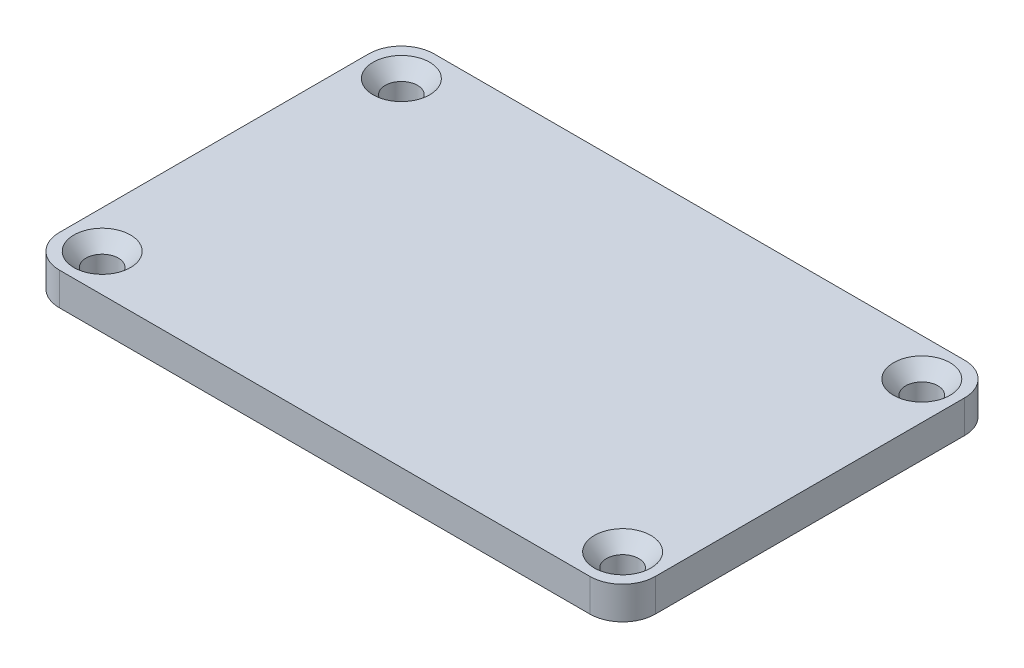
from build123d import *

# Parameters (mm, degrees)
SKETCH1_W                                      = 60.198
SKETCH1_H                                      = 37.846
BOSS_EXTRUDE1_DEPTH                            = 3.302
FILLET2_R                                      = 3.302
CSK_FOR_4_FLAT_HEAD_MACHINE_SCREW1_D           = 3.2639
CSK_FOR_4_FLAT_HEAD_MACHINE_SCREW1_CSINK_D     = 5.715
CSK_FOR_4_FLAT_HEAD_MACHINE_SCREW1_CSINK_ANGLE = 82


with BuildPart() as part:
    # Sketch1 → Boss-Extrude1 (new body)
    with BuildSketch(Plane(origin=(0, 0, 0), x_dir=(1, 0, 0), z_dir=(0, 1, 0))):
        Rectangle(SKETCH1_W, SKETCH1_H)
    extrude(amount=BOSS_EXTRUDE1_DEPTH)

    # Fillet2
    fillet2_edges = [part.edges().sort_by_distance(p)[0] for p in [
        (-30.099, 1.651, -18.923),
        (-30.099, 1.651, 18.923),
        (30.099, 1.651, 18.923),
        (30.099, 1.651, -18.923),
    ]]
    fillet(fillet2_edges, radius=FILLET2_R)

    # CSK for _4 Flat Head Machine Screw1 (through all)
    with Locations(Plane(origin=(0, 3.302, 0), x_dir=(1, 0, 0), z_dir=(0, 1, 0))):
        with Locations((-26.289, 15.113), (26.289, 15.113), (26.289, -15.113), (-26.289, -15.113)):
            CounterSinkHole(CSK_FOR_4_FLAT_HEAD_MACHINE_SCREW1_D / 2, CSK_FOR_4_FLAT_HEAD_MACHINE_SCREW1_CSINK_D / 2, counter_sink_angle=CSK_FOR_4_FLAT_HEAD_MACHINE_SCREW1_CSINK_ANGLE)


solid = part.part
